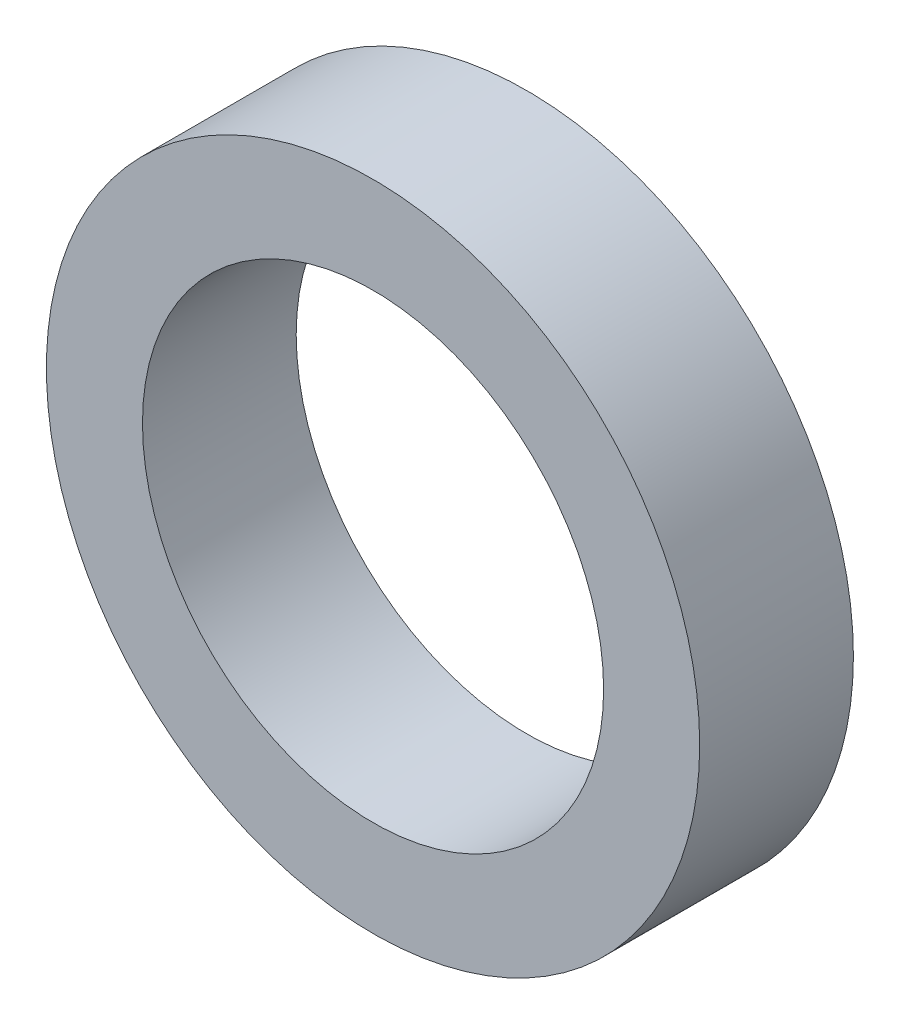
ISO-10303-21;
HEADER;
FILE_DESCRIPTION(('STEP AP214'),'2;1');
FILE_NAME('part.step','',(''),(''),'','','');
FILE_SCHEMA(('AUTOMOTIVE_DESIGN { 1 0 10303 214 1 1 1 1 }'));
ENDSEC;
DATA;
#1=APPLICATION_CONTEXT('core data for automotive mechanical design processes');
#2=APPLICATION_PROTOCOL_DEFINITION('international standard','automotive_design',2000,#1);
#3=PRODUCT_CONTEXT('',#1,'mechanical');
#4=PRODUCT('Part','Part','',(#3));
#5=PRODUCT_RELATED_PRODUCT_CATEGORY('part','',(#4));
#6=PRODUCT_DEFINITION_FORMATION('','',#4);
#7=PRODUCT_DEFINITION_CONTEXT('part definition',#1,'design');
#8=PRODUCT_DEFINITION('design','',#6,#7);
#9=PRODUCT_DEFINITION_SHAPE('','',#8);
#10=(LENGTH_UNIT() NAMED_UNIT(*) SI_UNIT(.MILLI.,.METRE.));
#11=(NAMED_UNIT(*) PLANE_ANGLE_UNIT() SI_UNIT($,.RADIAN.));
#12=(NAMED_UNIT(*) SI_UNIT($,.STERADIAN.) SOLID_ANGLE_UNIT());
#13=UNCERTAINTY_MEASURE_WITH_UNIT(LENGTH_MEASURE(1.E-05),#10,'distance_accuracy_value','');
#14=(GEOMETRIC_REPRESENTATION_CONTEXT(3) GLOBAL_UNCERTAINTY_ASSIGNED_CONTEXT((#13)) GLOBAL_UNIT_ASSIGNED_CONTEXT((#10,
#11,#12)) REPRESENTATION_CONTEXT('',''));
#15=CARTESIAN_POINT('',(0.,0.,0.));
#16=DIRECTION('',(0.,0.,1.));
#17=DIRECTION('',(1.,0.,0.));
#18=AXIS2_PLACEMENT_3D('',#15,#16,#17);
#19=CARTESIAN_POINT('',(0.,0.,4.));
#20=DIRECTION('',(0.,0.,-1.));
#21=DIRECTION('',(0.,1.,0.));
#22=AXIS2_PLACEMENT_3D('',#19,#20,#21);
#23=CYLINDRICAL_SURFACE('',#22,6.);
#24=CARTESIAN_POINT('',(0.,0.,4.));
#25=DIRECTION('',(0.,0.,-1.));
#26=DIRECTION('',(1.,0.,0.));
#27=AXIS2_PLACEMENT_3D('',#24,#25,#26);
#28=CIRCLE('',#27,6.);
#29=CARTESIAN_POINT('',(6.,0.,4.));
#30=VERTEX_POINT('',#29);
#31=EDGE_CURVE('E8',#30,#30,#28,.T.);
#32=ORIENTED_EDGE('',*,*,#31,.F.);
#33=EDGE_LOOP('',(#32));
#34=FACE_BOUND('',#33,.T.);
#35=CARTESIAN_POINT('',(0.,0.,0.));
#36=DIRECTION('',(0.,0.,-1.));
#37=DIRECTION('',(1.,0.,0.));
#38=AXIS2_PLACEMENT_3D('',#35,#36,#37);
#39=CIRCLE('',#38,6.);
#40=CARTESIAN_POINT('',(6.,0.,0.));
#41=VERTEX_POINT('',#40);
#42=EDGE_CURVE('E23',#41,#41,#39,.T.);
#43=ORIENTED_EDGE('',*,*,#42,.T.);
#44=EDGE_LOOP('',(#43));
#45=FACE_BOUND('',#44,.T.);
#46=ADVANCED_FACE('F12',(#34,#45),#23,.F.);
#47=CARTESIAN_POINT('',(0.,0.,4.));
#48=DIRECTION('',(0.,0.,-1.));
#49=DIRECTION('',(0.,1.,0.));
#50=AXIS2_PLACEMENT_3D('',#47,#48,#49);
#51=CYLINDRICAL_SURFACE('',#50,8.5);
#52=CARTESIAN_POINT('',(0.,0.,4.));
#53=DIRECTION('',(0.,0.,-1.));
#54=DIRECTION('',(1.,0.,0.));
#55=AXIS2_PLACEMENT_3D('',#52,#53,#54);
#56=CIRCLE('',#55,8.5);
#57=CARTESIAN_POINT('',(8.5,0.,4.));
#58=VERTEX_POINT('',#57);
#59=EDGE_CURVE('E19',#58,#58,#56,.T.);
#60=ORIENTED_EDGE('',*,*,#59,.T.);
#61=EDGE_LOOP('',(#60));
#62=FACE_BOUND('',#61,.T.);
#63=CARTESIAN_POINT('',(0.,0.,0.));
#64=DIRECTION('',(0.,0.,-1.));
#65=DIRECTION('',(1.,0.,0.));
#66=AXIS2_PLACEMENT_3D('',#63,#64,#65);
#67=CIRCLE('',#66,8.5);
#68=CARTESIAN_POINT('',(8.5,0.,0.));
#69=VERTEX_POINT('',#68);
#70=EDGE_CURVE('E28',#69,#69,#67,.T.);
#71=ORIENTED_EDGE('',*,*,#70,.F.);
#72=EDGE_LOOP('',(#71));
#73=FACE_BOUND('',#72,.T.);
#74=ADVANCED_FACE('F14',(#62,#73),#51,.T.);
#75=CARTESIAN_POINT('',(0.,0.,4.));
#76=DIRECTION('',(0.,0.,-1.));
#77=DIRECTION('',(0.,1.,0.));
#78=AXIS2_PLACEMENT_3D('',#75,#76,#77);
#79=PLANE('',#78);
#80=ORIENTED_EDGE('',*,*,#31,.T.);
#81=EDGE_LOOP('',(#80));
#82=FACE_BOUND('',#81,.T.);
#83=ORIENTED_EDGE('',*,*,#59,.F.);
#84=EDGE_LOOP('',(#83));
#85=FACE_BOUND('',#84,.T.);
#86=ADVANCED_FACE('F40',(#82,#85),#79,.F.);
#87=CARTESIAN_POINT('',(0.,0.,0.));
#88=DIRECTION('',(0.,0.,-1.));
#89=DIRECTION('',(0.,1.,0.));
#90=AXIS2_PLACEMENT_3D('',#87,#88,#89);
#91=PLANE('',#90);
#92=ORIENTED_EDGE('',*,*,#42,.F.);
#93=EDGE_LOOP('',(#92));
#94=FACE_BOUND('',#93,.T.);
#95=ORIENTED_EDGE('',*,*,#70,.T.);
#96=EDGE_LOOP('',(#95));
#97=FACE_BOUND('',#96,.T.);
#98=ADVANCED_FACE('F37',(#94,#97),#91,.T.);
#99=CLOSED_SHELL('',(#46,#74,#86,#98));
#100=MANIFOLD_SOLID_BREP('B1',#99);
#101=ADVANCED_BREP_SHAPE_REPRESENTATION('',(#18,#100),#14);
#102=SHAPE_DEFINITION_REPRESENTATION(#9,#101);
ENDSEC;
END-ISO-10303-21;
